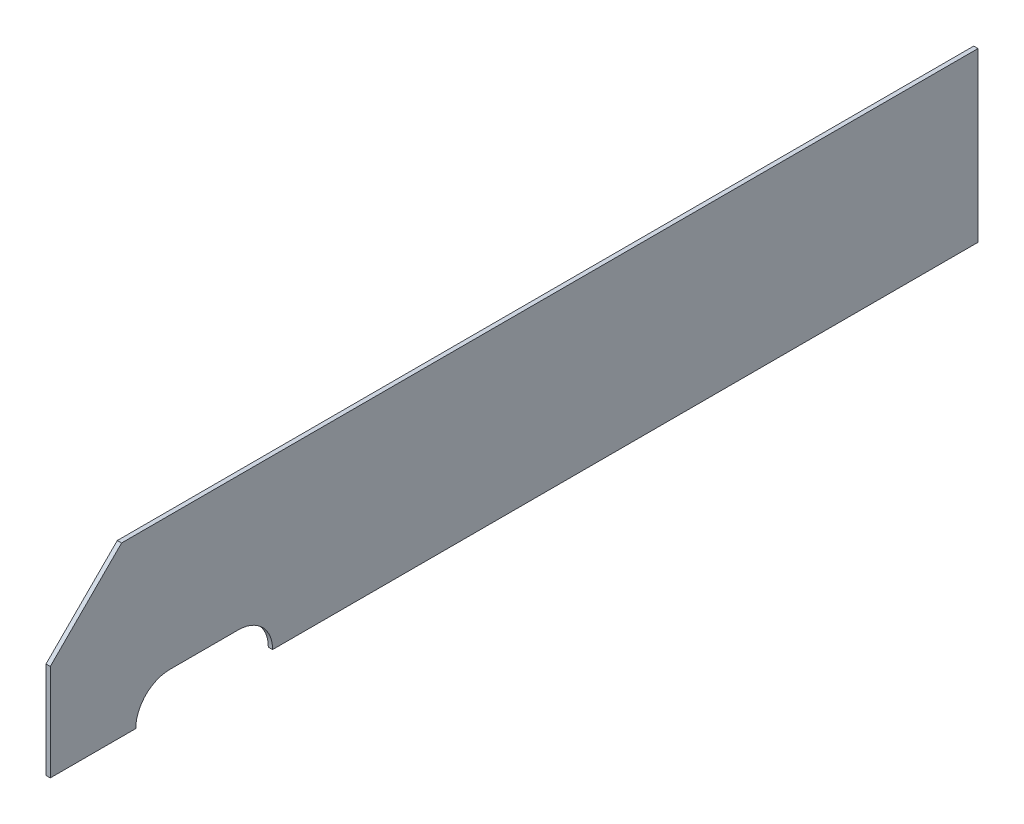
ISO-10303-21;
HEADER;
FILE_DESCRIPTION(('STEP AP214'),'2;1');
FILE_NAME('part.step','',(''),(''),'','','');
FILE_SCHEMA(('AUTOMOTIVE_DESIGN { 1 0 10303 214 1 1 1 1 }'));
ENDSEC;
DATA;
#1=APPLICATION_CONTEXT('core data for automotive mechanical design processes');
#2=APPLICATION_PROTOCOL_DEFINITION('international standard','automotive_design',2000,#1);
#3=PRODUCT_CONTEXT('',#1,'mechanical');
#4=PRODUCT('Part','Part','',(#3));
#5=PRODUCT_RELATED_PRODUCT_CATEGORY('part','',(#4));
#6=PRODUCT_DEFINITION_FORMATION('','',#4);
#7=PRODUCT_DEFINITION_CONTEXT('part definition',#1,'design');
#8=PRODUCT_DEFINITION('design','',#6,#7);
#9=PRODUCT_DEFINITION_SHAPE('','',#8);
#10=(LENGTH_UNIT() NAMED_UNIT(*) SI_UNIT(.MILLI.,.METRE.));
#11=(NAMED_UNIT(*) PLANE_ANGLE_UNIT() SI_UNIT($,.RADIAN.));
#12=(NAMED_UNIT(*) SI_UNIT($,.STERADIAN.) SOLID_ANGLE_UNIT());
#13=UNCERTAINTY_MEASURE_WITH_UNIT(LENGTH_MEASURE(1.E-05),#10,'distance_accuracy_value','');
#14=(GEOMETRIC_REPRESENTATION_CONTEXT(3) GLOBAL_UNCERTAINTY_ASSIGNED_CONTEXT((#13)) GLOBAL_UNIT_ASSIGNED_CONTEXT((#10,
#11,#12)) REPRESENTATION_CONTEXT('',''));
#15=CARTESIAN_POINT('',(0.,0.,0.));
#16=DIRECTION('',(0.,0.,1.));
#17=DIRECTION('',(1.,0.,0.));
#18=AXIS2_PLACEMENT_3D('',#15,#16,#17);
#19=CARTESIAN_POINT('',(-909.027870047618,277.550649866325,1391.59075221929));
#20=DIRECTION('',(0.,-1.,0.));
#21=DIRECTION('',(0.,0.,-1.));
#22=AXIS2_PLACEMENT_3D('',#19,#20,#21);
#23=PLANE('',#22);
#24=DIRECTION('',(-1.,0.,0.));
#25=VECTOR('',#24,1.);
#26=CARTESIAN_POINT('',(-909.027870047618,277.550649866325,1226.49075221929));
#27=LINE('',#26,#25);
#28=CARTESIAN_POINT('',(-912.202870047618,277.550649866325,1226.49075221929));
#29=VERTEX_POINT('',#28);
#30=CARTESIAN_POINT('',(-909.027870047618,277.550649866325,1226.49075221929));
#31=VERTEX_POINT('',#30);
#32=EDGE_CURVE('E139',#29,#31,#27,.F.);
#33=ORIENTED_EDGE('',*,*,#32,.F.);
#34=DIRECTION('',(0.,0.,1.));
#35=VECTOR('',#34,1.);
#36=CARTESIAN_POINT('',(-912.202870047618,277.550649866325,1391.59075221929));
#37=LINE('',#36,#35);
#38=CARTESIAN_POINT('',(-912.202870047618,277.550649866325,702.615752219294));
#39=VERTEX_POINT('',#38);
#40=EDGE_CURVE('E141',#39,#29,#37,.T.);
#41=ORIENTED_EDGE('',*,*,#40,.F.);
#42=DIRECTION('',(-1.,0.,0.));
#43=VECTOR('',#42,1.);
#44=CARTESIAN_POINT('',(-909.027870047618,277.550649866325,702.615752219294));
#45=LINE('',#44,#43);
#46=CARTESIAN_POINT('',(-909.027870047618,277.550649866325,702.615752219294));
#47=VERTEX_POINT('',#46);
#48=EDGE_CURVE('E121',#47,#39,#45,.T.);
#49=ORIENTED_EDGE('',*,*,#48,.F.);
#50=DIRECTION('',(0.,0.,1.));
#51=VECTOR('',#50,1.);
#52=CARTESIAN_POINT('',(-909.027870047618,277.550649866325,1391.59075221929));
#53=LINE('',#52,#51);
#54=EDGE_CURVE('E111',#47,#31,#53,.T.);
#55=ORIENTED_EDGE('',*,*,#54,.T.);
#56=EDGE_LOOP('',(#33,#41,#49,#55));
#57=FACE_BOUND('',#56,.T.);
#58=ADVANCED_FACE('F36',(#57),#23,.T.);
#59=CARTESIAN_POINT('',(-909.027870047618,0.,-1.58676236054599E-13));
#60=DIRECTION('',(1.,0.,0.));
#61=DIRECTION('',(0.,0.,-1.));
#62=AXIS2_PLACEMENT_3D('',#59,#60,#61);
#63=PLANE('',#62);
#64=DIRECTION('',(0.,0.,-1.));
#65=VECTOR('',#64,1.);
#66=CARTESIAN_POINT('',(-909.027870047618,302.950649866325,1251.89075221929));
#67=LINE('',#66,#65);
#68=CARTESIAN_POINT('',(-909.027870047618,302.950649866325,1302.69075221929));
#69=VERTEX_POINT('',#68);
#70=CARTESIAN_POINT('',(-909.027870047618,302.950649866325,1251.89075221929));
#71=VERTEX_POINT('',#70);
#72=EDGE_CURVE('E248',#69,#71,#67,.T.);
#73=ORIENTED_EDGE('',*,*,#72,.T.);
#74=CARTESIAN_POINT('',(-909.027870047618,277.550649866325,1251.89075221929));
#75=DIRECTION('',(-1.,0.,0.));
#76=DIRECTION('',(0.,0.,1.));
#77=AXIS2_PLACEMENT_3D('',#74,#75,#76);
#78=CIRCLE('',#77,25.4);
#79=EDGE_CURVE('E238',#71,#31,#78,.T.);
#80=ORIENTED_EDGE('',*,*,#79,.T.);
#81=ORIENTED_EDGE('',*,*,#54,.F.);
#82=DIRECTION('',(0.,-1.,0.));
#83=VECTOR('',#82,1.);
#84=CARTESIAN_POINT('',(-909.027870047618,277.550649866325,702.615752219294));
#85=LINE('',#84,#83);
#86=CARTESIAN_POINT('',(-909.027870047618,402.212122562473,702.615752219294));
#87=VERTEX_POINT('',#86);
#88=EDGE_CURVE('E113',#87,#47,#85,.T.);
#89=ORIENTED_EDGE('',*,*,#88,.F.);
#90=DIRECTION('',(0.,0.,-1.));
#91=VECTOR('',#90,1.);
#92=CARTESIAN_POINT('',(-909.027870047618,402.212122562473,702.615752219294));
#93=LINE('',#92,#91);
#94=CARTESIAN_POINT('',(-909.027870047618,402.212122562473,1338.63915146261));
#95=VERTEX_POINT('',#94);
#96=EDGE_CURVE('E147',#95,#87,#93,.T.);
#97=ORIENTED_EDGE('',*,*,#96,.F.);
#98=DIRECTION('',(0.,0.707106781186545,-0.70710678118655));
#99=VECTOR('',#98,1.);
#100=CARTESIAN_POINT('',(-909.027870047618,402.212122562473,1338.63915146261));
#101=LINE('',#100,#99);
#102=CARTESIAN_POINT('',(-909.027870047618,349.260521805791,1391.59075221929));
#103=VERTEX_POINT('',#102);
#104=EDGE_CURVE('E129',#103,#95,#101,.T.);
#105=ORIENTED_EDGE('',*,*,#104,.F.);
#106=DIRECTION('',(0.,1.,0.));
#107=VECTOR('',#106,1.);
#108=CARTESIAN_POINT('',(-909.027870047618,349.260521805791,1391.59075221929));
#109=LINE('',#108,#107);
#110=CARTESIAN_POINT('',(-909.027870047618,277.550649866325,1391.59075221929));
#111=VERTEX_POINT('',#110);
#112=EDGE_CURVE('E117',#111,#103,#109,.T.);
#113=ORIENTED_EDGE('',*,*,#112,.F.);
#114=CARTESIAN_POINT('',(-909.027870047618,277.550649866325,1328.09075221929));
#115=VERTEX_POINT('',#114);
#116=EDGE_CURVE('E105',#115,#111,#53,.T.);
#117=ORIENTED_EDGE('',*,*,#116,.F.);
#118=CARTESIAN_POINT('',(-909.027870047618,277.550649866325,1302.69075221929));
#119=DIRECTION('',(-1.,0.,0.));
#120=DIRECTION('',(0.,0.,1.));
#121=AXIS2_PLACEMENT_3D('',#118,#119,#120);
#122=CIRCLE('',#121,25.3999999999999);
#123=EDGE_CURVE('E227',#115,#69,#122,.T.);
#124=ORIENTED_EDGE('',*,*,#123,.T.);
#125=EDGE_LOOP('',(#73,#80,#81,#89,#97,#105,#113,#117,#124));
#126=FACE_BOUND('',#125,.T.);
#127=ADVANCED_FACE('F126',(#126),#63,.T.);
#128=CARTESIAN_POINT('',(-912.202870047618,0.,-1.59231347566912E-13));
#129=DIRECTION('',(1.,0.,0.));
#130=DIRECTION('',(0.,0.,-1.));
#131=AXIS2_PLACEMENT_3D('',#128,#129,#130);
#132=PLANE('',#131);
#133=CARTESIAN_POINT('',(-912.202870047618,277.550649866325,1251.89075221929));
#134=DIRECTION('',(-1.,0.,0.));
#135=DIRECTION('',(0.,0.,1.));
#136=AXIS2_PLACEMENT_3D('',#133,#134,#135);
#137=CIRCLE('',#136,25.4);
#138=CARTESIAN_POINT('',(-912.202870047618,302.950649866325,1251.89075221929));
#139=VERTEX_POINT('',#138);
#140=EDGE_CURVE('E236',#139,#29,#137,.T.);
#141=ORIENTED_EDGE('',*,*,#140,.F.);
#142=DIRECTION('',(0.,0.,-1.));
#143=VECTOR('',#142,1.);
#144=CARTESIAN_POINT('',(-912.202870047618,302.950649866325,1251.89075221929));
#145=LINE('',#144,#143);
#146=CARTESIAN_POINT('',(-912.202870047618,302.950649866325,1302.69075221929));
#147=VERTEX_POINT('',#146);
#148=EDGE_CURVE('E231',#147,#139,#145,.T.);
#149=ORIENTED_EDGE('',*,*,#148,.F.);
#150=CARTESIAN_POINT('',(-912.202870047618,277.550649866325,1302.69075221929));
#151=DIRECTION('',(-1.,0.,0.));
#152=DIRECTION('',(0.,0.,1.));
#153=AXIS2_PLACEMENT_3D('',#150,#151,#152);
#154=CIRCLE('',#153,25.3999999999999);
#155=CARTESIAN_POINT('',(-912.202870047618,277.550649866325,1328.09075221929));
#156=VERTEX_POINT('',#155);
#157=EDGE_CURVE('E11',#156,#147,#154,.T.);
#158=ORIENTED_EDGE('',*,*,#157,.F.);
#159=CARTESIAN_POINT('',(-912.202870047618,277.550649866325,1391.59075221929));
#160=VERTEX_POINT('',#159);
#161=EDGE_CURVE('E142',#156,#160,#37,.T.);
#162=ORIENTED_EDGE('',*,*,#161,.T.);
#163=DIRECTION('',(0.,1.,0.));
#164=VECTOR('',#163,1.);
#165=CARTESIAN_POINT('',(-912.202870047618,349.260521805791,1391.59075221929));
#166=LINE('',#165,#164);
#167=CARTESIAN_POINT('',(-912.202870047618,349.260521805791,1391.59075221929));
#168=VERTEX_POINT('',#167);
#169=EDGE_CURVE('E123',#160,#168,#166,.T.);
#170=ORIENTED_EDGE('',*,*,#169,.T.);
#171=DIRECTION('',(0.,0.707106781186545,-0.70710678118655));
#172=VECTOR('',#171,1.);
#173=CARTESIAN_POINT('',(-912.202870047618,402.212122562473,1338.63915146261));
#174=LINE('',#173,#172);
#175=CARTESIAN_POINT('',(-912.202870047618,402.212122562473,1338.63915146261));
#176=VERTEX_POINT('',#175);
#177=EDGE_CURVE('E150',#168,#176,#174,.T.);
#178=ORIENTED_EDGE('',*,*,#177,.T.);
#179=DIRECTION('',(0.,0.,-1.));
#180=VECTOR('',#179,1.);
#181=CARTESIAN_POINT('',(-912.202870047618,402.212122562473,702.615752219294));
#182=LINE('',#181,#180);
#183=CARTESIAN_POINT('',(-912.202870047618,402.212122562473,702.615752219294));
#184=VERTEX_POINT('',#183);
#185=EDGE_CURVE('E132',#176,#184,#182,.T.);
#186=ORIENTED_EDGE('',*,*,#185,.T.);
#187=DIRECTION('',(0.,-1.,0.));
#188=VECTOR('',#187,1.);
#189=CARTESIAN_POINT('',(-912.202870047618,277.550649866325,702.615752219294));
#190=LINE('',#189,#188);
#191=EDGE_CURVE('E138',#184,#39,#190,.T.);
#192=ORIENTED_EDGE('',*,*,#191,.T.);
#193=ORIENTED_EDGE('',*,*,#40,.T.);
#194=EDGE_LOOP('',(#141,#149,#158,#162,#170,#178,#186,#192,#193));
#195=FACE_BOUND('',#194,.T.);
#196=ADVANCED_FACE('F156',(#195),#132,.F.);
#197=CARTESIAN_POINT('',(-909.027870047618,402.212122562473,702.615752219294));
#198=DIRECTION('',(0.,1.,0.));
#199=DIRECTION('',(0.,0.,1.));
#200=AXIS2_PLACEMENT_3D('',#197,#198,#199);
#201=PLANE('',#200);
#202=ORIENTED_EDGE('',*,*,#185,.F.);
#203=DIRECTION('',(-1.,0.,0.));
#204=VECTOR('',#203,1.);
#205=CARTESIAN_POINT('',(-909.027870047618,402.212122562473,1338.63915146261));
#206=LINE('',#205,#204);
#207=EDGE_CURVE('E50',#95,#176,#206,.T.);
#208=ORIENTED_EDGE('',*,*,#207,.F.);
#209=ORIENTED_EDGE('',*,*,#96,.T.);
#210=DIRECTION('',(-1.,0.,0.));
#211=VECTOR('',#210,1.);
#212=CARTESIAN_POINT('',(-909.027870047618,402.212122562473,702.615752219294));
#213=LINE('',#212,#211);
#214=EDGE_CURVE('E45',#87,#184,#213,.T.);
#215=ORIENTED_EDGE('',*,*,#214,.T.);
#216=EDGE_LOOP('',(#202,#208,#209,#215));
#217=FACE_BOUND('',#216,.T.);
#218=ADVANCED_FACE('F37',(#217),#201,.T.);
#219=CARTESIAN_POINT('',(-909.027870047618,402.212122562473,1338.63915146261));
#220=DIRECTION('',(0.,0.70710678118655,0.707106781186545));
#221=DIRECTION('',(0.,-0.707106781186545,0.70710678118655));
#222=AXIS2_PLACEMENT_3D('',#219,#220,#221);
#223=PLANE('',#222);
#224=ORIENTED_EDGE('',*,*,#177,.F.);
#225=DIRECTION('',(-1.,0.,0.));
#226=VECTOR('',#225,1.);
#227=CARTESIAN_POINT('',(-909.027870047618,349.260521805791,1391.59075221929));
#228=LINE('',#227,#226);
#229=EDGE_CURVE('E124',#103,#168,#228,.T.);
#230=ORIENTED_EDGE('',*,*,#229,.F.);
#231=ORIENTED_EDGE('',*,*,#104,.T.);
#232=ORIENTED_EDGE('',*,*,#207,.T.);
#233=EDGE_LOOP('',(#224,#230,#231,#232));
#234=FACE_BOUND('',#233,.T.);
#235=ADVANCED_FACE('F160',(#234),#223,.T.);
#236=CARTESIAN_POINT('',(-909.027870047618,349.260521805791,1391.59075221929));
#237=DIRECTION('',(0.,0.,1.));
#238=DIRECTION('',(0.,-1.,0.));
#239=AXIS2_PLACEMENT_3D('',#236,#237,#238);
#240=PLANE('',#239);
#241=ORIENTED_EDGE('',*,*,#169,.F.);
#242=DIRECTION('',(-1.,0.,0.));
#243=VECTOR('',#242,1.);
#244=CARTESIAN_POINT('',(-909.027870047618,277.550649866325,1391.59075221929));
#245=LINE('',#244,#243);
#246=EDGE_CURVE('E106',#111,#160,#245,.T.);
#247=ORIENTED_EDGE('',*,*,#246,.F.);
#248=ORIENTED_EDGE('',*,*,#112,.T.);
#249=ORIENTED_EDGE('',*,*,#229,.T.);
#250=EDGE_LOOP('',(#241,#247,#248,#249));
#251=FACE_BOUND('',#250,.T.);
#252=ADVANCED_FACE('F118',(#251),#240,.T.);
#253=DIRECTION('',(-1.,0.,0.));
#254=VECTOR('',#253,1.);
#255=CARTESIAN_POINT('',(-909.027870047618,277.550649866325,1328.09075221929));
#256=LINE('',#255,#254);
#257=EDGE_CURVE('E109',#115,#156,#256,.T.);
#258=ORIENTED_EDGE('',*,*,#257,.F.);
#259=ORIENTED_EDGE('',*,*,#116,.T.);
#260=ORIENTED_EDGE('',*,*,#246,.T.);
#261=ORIENTED_EDGE('',*,*,#161,.F.);
#262=EDGE_LOOP('',(#258,#259,#260,#261));
#263=FACE_BOUND('',#262,.T.);
#264=ADVANCED_FACE('F102',(#263),#23,.T.);
#265=CARTESIAN_POINT('',(-909.027870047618,277.550649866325,702.615752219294));
#266=DIRECTION('',(0.,0.,-1.));
#267=DIRECTION('',(-1.,0.,0.));
#268=AXIS2_PLACEMENT_3D('',#265,#266,#267);
#269=PLANE('',#268);
#270=ORIENTED_EDGE('',*,*,#191,.F.);
#271=ORIENTED_EDGE('',*,*,#214,.F.);
#272=ORIENTED_EDGE('',*,*,#88,.T.);
#273=ORIENTED_EDGE('',*,*,#48,.T.);
#274=EDGE_LOOP('',(#270,#271,#272,#273));
#275=FACE_BOUND('',#274,.T.);
#276=ADVANCED_FACE('F153',(#275),#269,.T.);
#277=CARTESIAN_POINT('',(-909.027870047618,277.550649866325,1251.89075221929));
#278=DIRECTION('',(-1.,0.,0.));
#279=DIRECTION('',(0.,0.,1.));
#280=AXIS2_PLACEMENT_3D('',#277,#278,#279);
#281=CYLINDRICAL_SURFACE('',#280,25.4);
#282=ORIENTED_EDGE('',*,*,#32,.T.);
#283=ORIENTED_EDGE('',*,*,#79,.F.);
#284=DIRECTION('',(-1.,0.,0.));
#285=VECTOR('',#284,1.);
#286=CARTESIAN_POINT('',(-909.027870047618,302.950649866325,1251.89075221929));
#287=LINE('',#286,#285);
#288=EDGE_CURVE('E233',#71,#139,#287,.T.);
#289=ORIENTED_EDGE('',*,*,#288,.T.);
#290=ORIENTED_EDGE('',*,*,#140,.T.);
#291=EDGE_LOOP('',(#282,#283,#289,#290));
#292=FACE_BOUND('',#291,.T.);
#293=ADVANCED_FACE('F176',(#292),#281,.F.);
#294=CARTESIAN_POINT('',(-909.027870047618,302.950649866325,1251.89075221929));
#295=DIRECTION('',(0.,1.,0.));
#296=DIRECTION('',(0.,0.,1.));
#297=AXIS2_PLACEMENT_3D('',#294,#295,#296);
#298=PLANE('',#297);
#299=ORIENTED_EDGE('',*,*,#148,.T.);
#300=ORIENTED_EDGE('',*,*,#288,.F.);
#301=ORIENTED_EDGE('',*,*,#72,.F.);
#302=DIRECTION('',(-1.,0.,0.));
#303=VECTOR('',#302,1.);
#304=CARTESIAN_POINT('',(-909.027870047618,302.950649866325,1302.69075221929));
#305=LINE('',#304,#303);
#306=EDGE_CURVE('E54',#69,#147,#305,.T.);
#307=ORIENTED_EDGE('',*,*,#306,.T.);
#308=EDGE_LOOP('',(#299,#300,#301,#307));
#309=FACE_BOUND('',#308,.T.);
#310=ADVANCED_FACE('F181',(#309),#298,.F.);
#311=CARTESIAN_POINT('',(-909.027870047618,277.550649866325,1302.69075221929));
#312=DIRECTION('',(-1.,0.,0.));
#313=DIRECTION('',(0.,0.,1.));
#314=AXIS2_PLACEMENT_3D('',#311,#312,#313);
#315=CYLINDRICAL_SURFACE('',#314,25.3999999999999);
#316=ORIENTED_EDGE('',*,*,#257,.T.);
#317=ORIENTED_EDGE('',*,*,#157,.T.);
#318=ORIENTED_EDGE('',*,*,#306,.F.);
#319=ORIENTED_EDGE('',*,*,#123,.F.);
#320=EDGE_LOOP('',(#316,#317,#318,#319));
#321=FACE_BOUND('',#320,.T.);
#322=ADVANCED_FACE('F188',(#321),#315,.F.);
#323=CLOSED_SHELL('',(#58,#127,#196,#218,#235,#252,#264,#276,#293,#310,#322));
#324=MANIFOLD_SOLID_BREP('B2',#323);
#325=ADVANCED_BREP_SHAPE_REPRESENTATION('',(#18,#324),#14);
#326=SHAPE_DEFINITION_REPRESENTATION(#9,#325);
ENDSEC;
END-ISO-10303-21;
